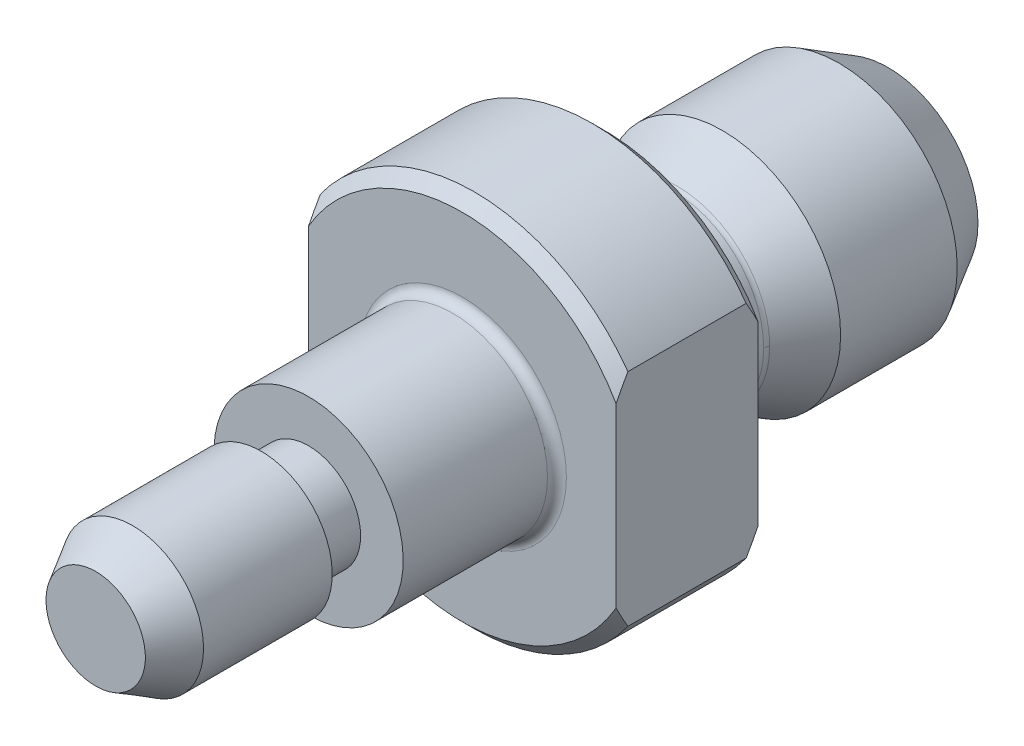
ISO-10303-21;
HEADER;
FILE_DESCRIPTION(('STEP AP214'),'2;1');
FILE_NAME('part.step','',(''),(''),'','','');
FILE_SCHEMA(('AUTOMOTIVE_DESIGN { 1 0 10303 214 1 1 1 1 }'));
ENDSEC;
DATA;
#1=APPLICATION_CONTEXT('core data for automotive mechanical design processes');
#2=APPLICATION_PROTOCOL_DEFINITION('international standard','automotive_design',2000,#1);
#3=PRODUCT_CONTEXT('',#1,'mechanical');
#4=PRODUCT('Part','Part','',(#3));
#5=PRODUCT_RELATED_PRODUCT_CATEGORY('part','',(#4));
#6=PRODUCT_DEFINITION_FORMATION('','',#4);
#7=PRODUCT_DEFINITION_CONTEXT('part definition',#1,'design');
#8=PRODUCT_DEFINITION('design','',#6,#7);
#9=PRODUCT_DEFINITION_SHAPE('','',#8);
#10=(LENGTH_UNIT() NAMED_UNIT(*) SI_UNIT(.MILLI.,.METRE.));
#11=(NAMED_UNIT(*) PLANE_ANGLE_UNIT() SI_UNIT($,.RADIAN.));
#12=(NAMED_UNIT(*) SI_UNIT($,.STERADIAN.) SOLID_ANGLE_UNIT());
#13=UNCERTAINTY_MEASURE_WITH_UNIT(LENGTH_MEASURE(1.E-05),#10,'distance_accuracy_value','');
#14=(GEOMETRIC_REPRESENTATION_CONTEXT(3) GLOBAL_UNCERTAINTY_ASSIGNED_CONTEXT((#13)) GLOBAL_UNIT_ASSIGNED_CONTEXT((#10,
#11,#12)) REPRESENTATION_CONTEXT('',''));
#15=CARTESIAN_POINT('',(0.,0.,0.));
#16=DIRECTION('',(0.,0.,1.));
#17=DIRECTION('',(1.,0.,0.));
#18=AXIS2_PLACEMENT_3D('',#15,#16,#17);
#19=CARTESIAN_POINT('',(-2.1252,-2.132512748,21.5));
#20=DIRECTION('',(0.,0.,1.));
#21=DIRECTION('',(1.,0.,0.));
#22=AXIS2_PLACEMENT_3D('',#19,#20,#21);
#23=PLANE('',#22);
#24=CARTESIAN_POINT('',(0.,0.,21.5));
#25=DIRECTION('',(0.,0.,-1.));
#26=DIRECTION('',(-1.,0.,0.));
#27=AXIS2_PLACEMENT_3D('',#24,#25,#26);
#28=CIRCLE('',#27,2.1);
#29=CARTESIAN_POINT('',(-2.1,0.,21.5));
#30=VERTEX_POINT('',#29);
#31=EDGE_CURVE('E18',#30,#30,#28,.T.);
#32=ORIENTED_EDGE('',*,*,#31,.F.);
#33=EDGE_LOOP('',(#32));
#34=FACE_BOUND('',#33,.T.);
#35=ADVANCED_FACE('F14',(#34),#23,.T.);
#36=CARTESIAN_POINT('',(0.,0.,21.5));
#37=DIRECTION('',(0.,0.,-1.));
#38=DIRECTION('',(-1.,0.,0.));
#39=AXIS2_PLACEMENT_3D('',#36,#37,#38);
#40=CONICAL_SURFACE('',#39,2.1,0.523598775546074);
#41=ORIENTED_EDGE('',*,*,#31,.T.);
#42=EDGE_LOOP('',(#41));
#43=FACE_BOUND('',#42,.T.);
#44=CARTESIAN_POINT('',(0.,0.,19.941154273));
#45=DIRECTION('',(0.,0.,1.));
#46=DIRECTION('',(1.,0.,0.));
#47=AXIS2_PLACEMENT_3D('',#44,#45,#46);
#48=CIRCLE('',#47,3.);
#49=CARTESIAN_POINT('',(3.,0.,19.941154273));
#50=VERTEX_POINT('',#49);
#51=EDGE_CURVE('E211',#50,#50,#48,.F.);
#52=ORIENTED_EDGE('',*,*,#51,.F.);
#53=EDGE_LOOP('',(#52));
#54=FACE_BOUND('',#53,.T.);
#55=ADVANCED_FACE('F325',(#43,#54),#40,.T.);
#56=CARTESIAN_POINT('',(0.,0.,14.5));
#57=DIRECTION('',(0.,0.,1.));
#58=DIRECTION('',(0.,-1.,0.));
#59=AXIS2_PLACEMENT_3D('',#56,#57,#58);
#60=CYLINDRICAL_SURFACE('',#59,3.);
#61=CARTESIAN_POINT('',(0.,0.,14.5));
#62=DIRECTION('',(0.,0.,1.));
#63=DIRECTION('',(0.,-1.,0.));
#64=AXIS2_PLACEMENT_3D('',#61,#62,#63);
#65=CIRCLE('',#64,3.);
#66=CARTESIAN_POINT('',(0.,-3.,14.5));
#67=VERTEX_POINT('',#66);
#68=EDGE_CURVE('E209',#67,#67,#65,.F.);
#69=ORIENTED_EDGE('',*,*,#68,.F.);
#70=EDGE_LOOP('',(#69));
#71=FACE_BOUND('',#70,.T.);
#72=ORIENTED_EDGE('',*,*,#51,.T.);
#73=EDGE_LOOP('',(#72));
#74=FACE_BOUND('',#73,.T.);
#75=ADVANCED_FACE('F331',(#71,#74),#60,.T.);
#76=CARTESIAN_POINT('',(3.036,-3.046446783,14.5));
#77=DIRECTION('',(0.,0.,-1.));
#78=DIRECTION('',(-1.,0.,0.));
#79=AXIS2_PLACEMENT_3D('',#76,#77,#78);
#80=PLANE('',#79);
#81=CARTESIAN_POINT('',(0.,0.,14.5));
#82=DIRECTION('',(0.,0.,1.));
#83=DIRECTION('',(1.,0.,0.));
#84=AXIS2_PLACEMENT_3D('',#81,#82,#83);
#85=CIRCLE('',#84,2.2);
#86=CARTESIAN_POINT('',(2.2,0.,14.5));
#87=VERTEX_POINT('',#86);
#88=EDGE_CURVE('E207',#87,#87,#85,.F.);
#89=ORIENTED_EDGE('',*,*,#88,.F.);
#90=EDGE_LOOP('',(#89));
#91=FACE_BOUND('',#90,.T.);
#92=ORIENTED_EDGE('',*,*,#68,.T.);
#93=EDGE_LOOP('',(#92));
#94=FACE_BOUND('',#93,.T.);
#95=ADVANCED_FACE('F327',(#91,#94),#80,.T.);
#96=CARTESIAN_POINT('',(0.,0.,12.5));
#97=DIRECTION('',(0.,0.,1.));
#98=DIRECTION('',(1.,0.,0.));
#99=AXIS2_PLACEMENT_3D('',#96,#97,#98);
#100=CYLINDRICAL_SURFACE('',#99,2.2);
#101=CARTESIAN_POINT('',(0.,0.,12.5));
#102=DIRECTION('',(0.,0.,1.));
#103=DIRECTION('',(1.,0.,0.));
#104=AXIS2_PLACEMENT_3D('',#101,#102,#103);
#105=CIRCLE('',#104,2.2);
#106=CARTESIAN_POINT('',(2.2,0.,12.5));
#107=VERTEX_POINT('',#106);
#108=EDGE_CURVE('E204',#107,#107,#105,.F.);
#109=ORIENTED_EDGE('',*,*,#108,.F.);
#110=EDGE_LOOP('',(#109));
#111=FACE_BOUND('',#110,.T.);
#112=ORIENTED_EDGE('',*,*,#88,.T.);
#113=EDGE_LOOP('',(#112));
#114=FACE_BOUND('',#113,.T.);
#115=ADVANCED_FACE('F330',(#111,#114),#100,.T.);
#116=CARTESIAN_POINT('',(-4.048,-4.061929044,12.5));
#117=DIRECTION('',(0.,0.,1.));
#118=DIRECTION('',(1.,0.,0.));
#119=AXIS2_PLACEMENT_3D('',#116,#117,#118);
#120=PLANE('',#119);
#121=ORIENTED_EDGE('',*,*,#108,.T.);
#122=EDGE_LOOP('',(#121));
#123=FACE_BOUND('',#122,.T.);
#124=CARTESIAN_POINT('',(0.,0.,12.5));
#125=DIRECTION('',(0.,0.,1.));
#126=DIRECTION('',(0.,-1.,0.));
#127=AXIS2_PLACEMENT_3D('',#124,#125,#126);
#128=CIRCLE('',#127,4.);
#129=CARTESIAN_POINT('',(0.,-4.,12.5));
#130=VERTEX_POINT('',#129);
#131=EDGE_CURVE('E200',#130,#130,#128,.F.);
#132=ORIENTED_EDGE('',*,*,#131,.F.);
#133=EDGE_LOOP('',(#132));
#134=FACE_BOUND('',#133,.T.);
#135=ADVANCED_FACE('F333',(#123,#134),#120,.T.);
#136=CARTESIAN_POINT('',(0.,0.,6.4));
#137=DIRECTION('',(0.,0.,1.));
#138=DIRECTION('',(0.,-1.,0.));
#139=AXIS2_PLACEMENT_3D('',#136,#137,#138);
#140=CYLINDRICAL_SURFACE('',#139,4.);
#141=CARTESIAN_POINT('',(0.,0.,6.4));
#142=DIRECTION('',(0.,0.,1.));
#143=DIRECTION('',(1.,0.,0.));
#144=AXIS2_PLACEMENT_3D('',#141,#142,#143);
#145=CIRCLE('',#144,4.);
#146=CARTESIAN_POINT('',(4.,0.,6.4));
#147=VERTEX_POINT('',#146);
#148=EDGE_CURVE('E203',#147,#147,#145,.T.);
#149=ORIENTED_EDGE('',*,*,#148,.T.);
#150=EDGE_LOOP('',(#149));
#151=FACE_BOUND('',#150,.T.);
#152=ORIENTED_EDGE('',*,*,#131,.T.);
#153=EDGE_LOOP('',(#152));
#154=FACE_BOUND('',#153,.T.);
#155=ADVANCED_FACE('F336',(#151,#154),#140,.T.);
#156=CARTESIAN_POINT('',(0.,0.,6.4));
#157=DIRECTION('',(0.,0.,1.));
#158=DIRECTION('',(1.,0.,0.));
#159=AXIS2_PLACEMENT_3D('',#156,#157,#158);
#160=TOROIDAL_SURFACE('',#159,4.4,0.4);
#161=CARTESIAN_POINT('',(0.,0.,6.));
#162=DIRECTION('',(0.,0.,1.));
#163=DIRECTION('',(1.,0.,0.));
#164=AXIS2_PLACEMENT_3D('',#161,#162,#163);
#165=CIRCLE('',#164,4.399999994);
#166=CARTESIAN_POINT('',(4.399999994,0.,6.));
#167=VERTEX_POINT('',#166);
#168=EDGE_CURVE('E97',#167,#167,#165,.F.);
#169=ORIENTED_EDGE('',*,*,#168,.F.);
#170=EDGE_LOOP('',(#169));
#171=FACE_BOUND('',#170,.T.);
#172=ORIENTED_EDGE('',*,*,#148,.F.);
#173=EDGE_LOOP('',(#172));
#174=FACE_BOUND('',#173,.T.);
#175=ADVANCED_FACE('F338',(#171,#174),#160,.F.);
#176=CARTESIAN_POINT('',(0.,0.,0.5));
#177=DIRECTION('',(0.,0.,1.));
#178=DIRECTION('',(1.,0.,0.));
#179=AXIS2_PLACEMENT_3D('',#176,#177,#178);
#180=CYLINDRICAL_SURFACE('',#179,8.);
#181=CARTESIAN_POINT('',(0.,0.,0.5));
#182=DIRECTION('',(0.,0.,1.));
#183=DIRECTION('',(1.,0.,0.));
#184=AXIS2_PLACEMENT_3D('',#181,#182,#183);
#185=CIRCLE('',#184,8.);
#186=CARTESIAN_POINT('',(6.5,-4.66368952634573,0.499999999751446));
#187=VERTEX_POINT('',#186);
#188=CARTESIAN_POINT('',(-6.5,-4.6636895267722,0.500000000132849));
#189=VERTEX_POINT('',#188);
#190=EDGE_CURVE('E247',#187,#189,#185,.F.);
#191=ORIENTED_EDGE('',*,*,#190,.F.);
#192=DIRECTION('',(0.,0.,-1.));
#193=VECTOR('',#192,1.);
#194=CARTESIAN_POINT('',(6.5,-4.663689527,3.));
#195=LINE('',#194,#193);
#196=CARTESIAN_POINT('',(6.5,-4.6636895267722,5.49999999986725));
#197=VERTEX_POINT('',#196);
#198=EDGE_CURVE('E159',#197,#187,#195,.T.);
#199=ORIENTED_EDGE('',*,*,#198,.F.);
#200=CARTESIAN_POINT('',(0.,0.,5.5));
#201=DIRECTION('',(0.,0.,-1.));
#202=DIRECTION('',(-1.,0.,0.));
#203=AXIS2_PLACEMENT_3D('',#200,#201,#202);
#204=CIRCLE('',#203,8.);
#205=CARTESIAN_POINT('',(-6.5,-4.66368952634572,5.50000000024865));
#206=VERTEX_POINT('',#205);
#207=EDGE_CURVE('E197',#206,#197,#204,.F.);
#208=ORIENTED_EDGE('',*,*,#207,.F.);
#209=DIRECTION('',(0.,0.,1.));
#210=VECTOR('',#209,1.);
#211=CARTESIAN_POINT('',(-6.5,-4.663689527,3.));
#212=LINE('',#211,#210);
#213=EDGE_CURVE('E183',#189,#206,#212,.T.);
#214=ORIENTED_EDGE('',*,*,#213,.F.);
#215=EDGE_LOOP('',(#191,#199,#208,#214));
#216=FACE_BOUND('',#215,.T.);
#217=ADVANCED_FACE('F340',(#216),#180,.T.);
#218=CARTESIAN_POINT('',(0.,0.,0.5));
#219=DIRECTION('',(0.,0.,1.));
#220=DIRECTION('',(1.,0.,0.));
#221=AXIS2_PLACEMENT_3D('',#218,#219,#220);
#222=CYLINDRICAL_SURFACE('',#221,8.);
#223=CARTESIAN_POINT('',(0.,0.,5.5));
#224=DIRECTION('',(0.,0.,-1.));
#225=DIRECTION('',(-1.,0.,0.));
#226=AXIS2_PLACEMENT_3D('',#223,#224,#225);
#227=CIRCLE('',#226,8.);
#228=CARTESIAN_POINT('',(6.5,4.66368952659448,5.50000000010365));
#229=VERTEX_POINT('',#228);
#230=CARTESIAN_POINT('',(-6.5,4.6636895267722,5.49999999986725));
#231=VERTEX_POINT('',#230);
#232=EDGE_CURVE('E98',#229,#231,#227,.F.);
#233=ORIENTED_EDGE('',*,*,#232,.F.);
#234=DIRECTION('',(0.,0.,1.));
#235=VECTOR('',#234,1.);
#236=CARTESIAN_POINT('',(6.5,4.663689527,3.));
#237=LINE('',#236,#235);
#238=CARTESIAN_POINT('',(6.5,4.6636895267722,0.500000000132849));
#239=VERTEX_POINT('',#238);
#240=EDGE_CURVE('E113',#239,#229,#237,.T.);
#241=ORIENTED_EDGE('',*,*,#240,.F.);
#242=CARTESIAN_POINT('',(0.,0.,0.5));
#243=DIRECTION('',(0.,0.,1.));
#244=DIRECTION('',(1.,0.,0.));
#245=AXIS2_PLACEMENT_3D('',#242,#243,#244);
#246=CIRCLE('',#245,8.);
#247=CARTESIAN_POINT('',(-6.5,4.6636895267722,0.500000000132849));
#248=VERTEX_POINT('',#247);
#249=EDGE_CURVE('E254',#248,#239,#246,.F.);
#250=ORIENTED_EDGE('',*,*,#249,.F.);
#251=DIRECTION('',(0.,0.,-1.));
#252=VECTOR('',#251,1.);
#253=CARTESIAN_POINT('',(-6.5,4.663689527,3.));
#254=LINE('',#253,#252);
#255=EDGE_CURVE('E184',#231,#248,#254,.T.);
#256=ORIENTED_EDGE('',*,*,#255,.F.);
#257=EDGE_LOOP('',(#233,#241,#250,#256));
#258=FACE_BOUND('',#257,.T.);
#259=ADVANCED_FACE('F349',(#258),#222,.T.);
#260=CARTESIAN_POINT('',(0.,0.,6.));
#261=DIRECTION('',(0.,0.,-1.));
#262=DIRECTION('',(-1.,0.,0.));
#263=AXIS2_PLACEMENT_3D('',#260,#261,#262);
#264=CONICAL_SURFACE('',#263,7.5,0.785398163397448);
#265=CARTESIAN_POINT('',(0.,0.,6.));
#266=DIRECTION('',(0.,0.,-1.));
#267=DIRECTION('',(-1.,0.,0.));
#268=AXIS2_PLACEMENT_3D('',#265,#266,#267);
#269=CIRCLE('',#268,7.5);
#270=CARTESIAN_POINT('',(6.5,3.7416573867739,6.));
#271=VERTEX_POINT('',#270);
#272=CARTESIAN_POINT('',(-6.5,3.74165738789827,5.9999999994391));
#273=VERTEX_POINT('',#272);
#274=EDGE_CURVE('E87',#271,#273,#269,.F.);
#275=ORIENTED_EDGE('',*,*,#274,.F.);
#276=CARTESIAN_POINT('',(6.50000000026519,4.66368952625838,5.5000000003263));
#277=CARTESIAN_POINT('',(6.50000000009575,4.58815546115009,5.54403197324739));
#278=CARTESIAN_POINT('',(6.50000000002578,4.51231410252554,5.58753977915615));
#279=CARTESIAN_POINT('',(6.49999999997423,4.36000596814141,5.67339851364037));
#280=CARTESIAN_POINT('',(6.49999999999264,4.28353936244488,5.71574974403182));
#281=CARTESIAN_POINT('',(6.50000000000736,4.12992806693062,5.79921121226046));
#282=CARTESIAN_POINT('',(6.50000000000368,4.05278335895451,5.84032141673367));
#283=CARTESIAN_POINT('',(6.49999999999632,3.89776768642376,5.92119893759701));
#284=CARTESIAN_POINT('',(6.49999999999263,3.81989653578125,5.9609658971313));
#285=CARTESIAN_POINT('',(6.5,3.74165738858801,5.999999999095));
#286=B_SPLINE_CURVE_WITH_KNOTS('',3,(#276,#277,#278,#279,#280,#281,#282,#283,#284,#285),
.UNSPECIFIED.,.F.,.F.,(4,2,2,2,4),(0.,0.262293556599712,0.524517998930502,0.786749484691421,
1.04905009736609),.UNSPECIFIED.);
#287=EDGE_CURVE('E91',#229,#271,#286,.T.);
#288=ORIENTED_EDGE('',*,*,#287,.F.);
#289=ORIENTED_EDGE('',*,*,#232,.T.);
#290=CARTESIAN_POINT('',(-6.50000000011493,3.74165738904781,5.9999999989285));
#291=CARTESIAN_POINT('',(-6.5000000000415,3.81989653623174,5.96096589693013));
#292=CARTESIAN_POINT('',(-6.50000000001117,3.89776768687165,5.92119893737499));
#293=CARTESIAN_POINT('',(-6.49999999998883,4.05278335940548,5.84032141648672));
#294=CARTESIAN_POINT('',(-6.49999999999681,4.12992806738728,5.79921121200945));
#295=CARTESIAN_POINT('',(-6.50000000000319,4.28353936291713,5.71574974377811));
#296=CARTESIAN_POINT('',(-6.5000000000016,4.36000596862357,5.67339851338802));
#297=CARTESIAN_POINT('',(-6.4999999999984,4.51231410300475,5.58753977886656));
#298=CARTESIAN_POINT('',(-6.49999999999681,4.58815546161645,5.5440319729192));
#299=CARTESIAN_POINT('',(-6.5,4.66368952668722,5.49999999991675));
#300=B_SPLINE_CURVE_WITH_KNOTS('',3,(#290,#291,#292,#293,#294,#295,#296,#297,#298,#299),
.UNSPECIFIED.,.F.,.F.,(4,2,2,2,4),(0.,0.262300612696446,0.524532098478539,0.78675654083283,
1.0490500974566),.UNSPECIFIED.);
#301=EDGE_CURVE('E94',#273,#231,#300,.T.);
#302=ORIENTED_EDGE('',*,*,#301,.F.);
#303=EDGE_LOOP('',(#275,#288,#289,#302));
#304=FACE_BOUND('',#303,.T.);
#305=ADVANCED_FACE('F89',(#304),#264,.T.);
#306=CARTESIAN_POINT('',(-6.5,-7.654775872,6.));
#307=DIRECTION('',(0.,0.,1.));
#308=DIRECTION('',(1.,0.,0.));
#309=AXIS2_PLACEMENT_3D('',#306,#307,#308);
#310=PLANE('',#309);
#311=ORIENTED_EDGE('',*,*,#168,.T.);
#312=EDGE_LOOP('',(#311));
#313=FACE_BOUND('',#312,.T.);
#314=CARTESIAN_POINT('',(0.,0.,6.));
#315=DIRECTION('',(0.,0.,-1.));
#316=DIRECTION('',(-1.,0.,0.));
#317=AXIS2_PLACEMENT_3D('',#314,#315,#316);
#318=CIRCLE('',#317,7.5);
#319=CARTESIAN_POINT('',(6.5,-3.7416573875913,5.99999999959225));
#320=VERTEX_POINT('',#319);
#321=CARTESIAN_POINT('',(-6.5,-3.7416573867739,6.));
#322=VERTEX_POINT('',#321);
#323=EDGE_CURVE('E104',#320,#322,#318,.T.);
#324=ORIENTED_EDGE('',*,*,#323,.F.);
#325=DIRECTION('',(0.,-1.,0.));
#326=VECTOR('',#325,1.);
#327=CARTESIAN_POINT('',(6.5,0.,6.));
#328=LINE('',#327,#326);
#329=EDGE_CURVE('E101',#271,#320,#328,.T.);
#330=ORIENTED_EDGE('',*,*,#329,.F.);
#331=ORIENTED_EDGE('',*,*,#274,.T.);
#332=DIRECTION('',(0.,1.,0.));
#333=VECTOR('',#332,1.);
#334=CARTESIAN_POINT('',(-6.5,0.,6.));
#335=LINE('',#334,#333);
#336=EDGE_CURVE('E195',#322,#273,#335,.T.);
#337=ORIENTED_EDGE('',*,*,#336,.F.);
#338=EDGE_LOOP('',(#324,#330,#331,#337));
#339=FACE_BOUND('',#338,.T.);
#340=ADVANCED_FACE('F102',(#313,#339),#310,.T.);
#341=CARTESIAN_POINT('',(0.,0.,6.));
#342=DIRECTION('',(0.,0.,-1.));
#343=DIRECTION('',(-1.,0.,0.));
#344=AXIS2_PLACEMENT_3D('',#341,#342,#343);
#345=CONICAL_SURFACE('',#344,7.5,0.785398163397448);
#346=ORIENTED_EDGE('',*,*,#207,.T.);
#347=CARTESIAN_POINT('',(6.5,-3.74165738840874,5.9999999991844));
#348=CARTESIAN_POINT('',(6.5,-3.81989653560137,5.9609658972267));
#349=CARTESIAN_POINT('',(6.5,-3.89776768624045,5.92119893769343));
#350=CARTESIAN_POINT('',(6.5,-4.05278335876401,5.84032141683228));
#351=CARTESIAN_POINT('',(6.5,-4.12992806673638,5.79921121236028));
#352=CARTESIAN_POINT('',(6.5,-4.28353936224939,5.71574974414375));
#353=CARTESIAN_POINT('',(6.5,-4.3600059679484,5.67339851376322));
#354=CARTESIAN_POINT('',(6.5,-4.51231410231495,5.58753977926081));
#355=CARTESIAN_POINT('',(6.5,-4.58815546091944,5.54403197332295));
#356=CARTESIAN_POINT('',(6.5,-4.66368952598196,5.5000000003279));
#357=B_SPLINE_CURVE_WITH_KNOTS('',3,(#347,#348,#349,#350,#351,#352,#353,#354,#355,#356),
.UNSPECIFIED.,.F.,.F.,(4,2,2,2,4),(0.,0.262300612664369,0.524532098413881,0.78675654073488,
1.04905009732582),.UNSPECIFIED.);
#358=EDGE_CURVE('E108',#320,#197,#357,.T.);
#359=ORIENTED_EDGE('',*,*,#358,.F.);
#360=ORIENTED_EDGE('',*,*,#323,.T.);
#361=CARTESIAN_POINT('',(-6.5,-4.66368952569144,5.50000000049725));
#362=CARTESIAN_POINT('',(-6.5,-4.5881554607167,5.54403197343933));
#363=CARTESIAN_POINT('',(-6.5,-4.51231410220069,5.58753977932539));
#364=CARTESIAN_POINT('',(-6.5,-4.36000596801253,5.6733985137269));
#365=CARTESIAN_POINT('',(-6.5,-4.28353936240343,5.71574974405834));
#366=CARTESIAN_POINT('',(-6.5,-4.12992806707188,5.7992112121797));
#367=CARTESIAN_POINT('',(-6.5,-4.05278335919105,5.84032141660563));
#368=CARTESIAN_POINT('',(-6.5,-3.89776768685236,5.92119893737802));
#369=CARTESIAN_POINT('',(-6.5,-3.81989653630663,5.96096589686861));
#370=CARTESIAN_POINT('',(-6.5,-3.74165738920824,5.99999999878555));
#371=B_SPLINE_CURVE_WITH_KNOTS('',3,(#361,#362,#363,#364,#365,#366,#367,#368,#369,#370),
.UNSPECIFIED.,.F.,.F.,(4,2,2,2,4),(0.,0.262293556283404,0.524517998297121,0.786749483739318,
1.04905009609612),.UNSPECIFIED.);
#372=EDGE_CURVE('E185',#206,#322,#371,.T.);
#373=ORIENTED_EDGE('',*,*,#372,.F.);
#374=EDGE_LOOP('',(#346,#359,#360,#373));
#375=FACE_BOUND('',#374,.T.);
#376=ADVANCED_FACE('F169',(#375),#345,.T.);
#377=CARTESIAN_POINT('',(0.,0.,0.));
#378=DIRECTION('',(0.,0.,1.));
#379=DIRECTION('',(0.,-1.,0.));
#380=AXIS2_PLACEMENT_3D('',#377,#378,#379);
#381=CONICAL_SURFACE('',#380,7.5,0.785398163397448);
#382=CARTESIAN_POINT('',(0.,0.,0.));
#383=DIRECTION('',(0.,0.,1.));
#384=DIRECTION('',(0.,-1.,0.));
#385=AXIS2_PLACEMENT_3D('',#382,#383,#384);
#386=CIRCLE('',#385,7.5);
#387=CARTESIAN_POINT('',(6.5,-3.74165738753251,3.784472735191E-10));
#388=VERTEX_POINT('',#387);
#389=CARTESIAN_POINT('',(-6.5,-3.74165738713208,1.78648762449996E-10));
#390=VERTEX_POINT('',#389);
#391=EDGE_CURVE('E233',#388,#390,#386,.F.);
#392=ORIENTED_EDGE('',*,*,#391,.F.);
#393=CARTESIAN_POINT('',(6.5,-4.66368952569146,0.499999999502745));
#394=CARTESIAN_POINT('',(6.5,-4.58815546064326,0.455968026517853));
#395=CARTESIAN_POINT('',(6.5,-4.51231410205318,0.41246022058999));
#396=CARTESIAN_POINT('',(6.5,-4.36000596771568,0.326601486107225));
#397=CARTESIAN_POINT('',(6.5,-4.2835393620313,0.284250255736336));
#398=CARTESIAN_POINT('',(6.5,-4.12992806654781,0.200788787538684));
#399=CARTESIAN_POINT('',(6.5,-4.05278335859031,0.159678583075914));
#400=CARTESIAN_POINT('',(6.5,-3.89776768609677,0.0788010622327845));
#401=CARTESIAN_POINT('',(6.5,-3.81989653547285,0.0390341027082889));
#402=CARTESIAN_POINT('',(6.5,-3.74165738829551,7.59097645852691E-10));
#403=B_SPLINE_CURVE_WITH_KNOTS('',3,(#393,#394,#395,#396,#397,#398,#399,#400,#401,#402),
.UNSPECIFIED.,.F.,.F.,(4,2,2,2,4),(0.,0.262293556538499,0.524517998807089,0.78674948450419,
1.04905009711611),.UNSPECIFIED.);
#404=EDGE_CURVE('E151',#187,#388,#403,.T.);
#405=ORIENTED_EDGE('',*,*,#404,.F.);
#406=ORIENTED_EDGE('',*,*,#190,.T.);
#407=CARTESIAN_POINT('',(-6.5,-3.74165738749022,3.5734956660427E-10));
#408=CARTESIAN_POINT('',(-6.5,-3.81989653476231,0.0390341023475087));
#409=CARTESIAN_POINT('',(-6.5,-3.89776768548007,0.0788010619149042));
#410=CARTESIAN_POINT('',(-6.5,-4.05278335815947,0.159678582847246));
#411=CARTESIAN_POINT('',(-6.5,-4.12992806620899,0.200788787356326));
#412=CARTESIAN_POINT('',(-6.5,-4.2835393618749,0.284250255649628));
#413=CARTESIAN_POINT('',(-6.5,-4.36000596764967,0.326601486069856));
#414=CARTESIAN_POINT('',(-6.5,-4.51231410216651,0.412460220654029));
#415=CARTESIAN_POINT('',(-6.5,-4.58815546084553,0.455968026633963));
#416=CARTESIAN_POINT('',(-6.5,-4.66368952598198,0.499999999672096));
#417=B_SPLINE_CURVE_WITH_KNOTS('',3,(#407,#408,#409,#410,#411,#412,#413,#414,#415,#416),
.UNSPECIFIED.,.F.,.F.,(4,2,2,2,4),(0.,0.262300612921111,0.524532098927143,0.78675654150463,
1.04905009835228),.UNSPECIFIED.);
#418=EDGE_CURVE('E176',#390,#189,#417,.T.);
#419=ORIENTED_EDGE('',*,*,#418,.F.);
#420=EDGE_LOOP('',(#392,#405,#406,#419));
#421=FACE_BOUND('',#420,.T.);
#422=ADVANCED_FACE('F166',(#421),#381,.T.);
#423=CARTESIAN_POINT('',(-6.5,-4.663689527,0.));
#424=DIRECTION('',(-1.,0.,0.));
#425=DIRECTION('',(0.,0.,1.));
#426=AXIS2_PLACEMENT_3D('',#423,#424,#425);
#427=PLANE('',#426);
#428=ORIENTED_EDGE('',*,*,#213,.T.);
#429=ORIENTED_EDGE('',*,*,#372,.T.);
#430=ORIENTED_EDGE('',*,*,#336,.T.);
#431=ORIENTED_EDGE('',*,*,#301,.T.);
#432=ORIENTED_EDGE('',*,*,#255,.T.);
#433=CARTESIAN_POINT('',(-6.5,3.74165738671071,-3.15511505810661E-11));
#434=CARTESIAN_POINT('',(-6.5,3.81989653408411,0.0390341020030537));
#435=CARTESIAN_POINT('',(-6.5,3.89776768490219,0.0788010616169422));
#436=CARTESIAN_POINT('',(-6.5,4.05278335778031,0.159678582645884));
#437=CARTESIAN_POINT('',(-6.5,4.12992806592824,0.20078878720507));
#438=CARTESIAN_POINT('',(-6.5,4.28353936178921,0.284250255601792));
#439=CARTESIAN_POINT('',(-6.5,4.36000596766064,0.326601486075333));
#440=CARTESIAN_POINT('',(-6.5,4.51231410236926,0.412460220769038));
#441=CARTESIAN_POINT('',(-6.5,4.5881554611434,0.455968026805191));
#442=CARTESIAN_POINT('',(-6.5,4.66368952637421,0.499999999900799));
#443=B_SPLINE_CURVE_WITH_KNOTS('',3,(#433,#434,#435,#436,#437,#438,#439,#440,#441,#442),
.UNSPECIFIED.,.F.,.F.,(4,2,2,2,4),(0.,0.262300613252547,0.524532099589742,0.786756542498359,
1.04905009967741),.UNSPECIFIED.);
#444=CARTESIAN_POINT('',(-6.5,3.74165738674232,-1.57998614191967E-11));
#445=VERTEX_POINT('',#444);
#446=EDGE_CURVE('E160',#445,#248,#443,.T.);
#447=ORIENTED_EDGE('',*,*,#446,.F.);
#448=DIRECTION('',(0.,1.,0.));
#449=VECTOR('',#448,1.);
#450=CARTESIAN_POINT('',(-6.5,0.,0.));
#451=LINE('',#450,#449);
#452=EDGE_CURVE('E232',#390,#445,#451,.T.);
#453=ORIENTED_EDGE('',*,*,#452,.F.);
#454=ORIENTED_EDGE('',*,*,#418,.T.);
#455=EDGE_LOOP('',(#428,#429,#430,#431,#432,#447,#453,#454));
#456=FACE_BOUND('',#455,.T.);
#457=ADVANCED_FACE('F145',(#456),#427,.T.);
#458=CARTESIAN_POINT('',(0.,0.,0.));
#459=DIRECTION('',(0.,0.,1.));
#460=DIRECTION('',(0.,-1.,0.));
#461=AXIS2_PLACEMENT_3D('',#458,#459,#460);
#462=CONICAL_SURFACE('',#461,7.5,0.785398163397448);
#463=ORIENTED_EDGE('',*,*,#249,.T.);
#464=CARTESIAN_POINT('',(6.4999999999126,3.74165738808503,7.01948915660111E-10));
#465=CARTESIAN_POINT('',(6.49999999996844,3.81989653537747,0.0390341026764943));
#466=CARTESIAN_POINT('',(6.4999999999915,3.89776768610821,0.0788010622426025));
#467=CARTESIAN_POINT('',(6.50000000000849,4.05278335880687,0.159678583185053));
#468=CARTESIAN_POINT('',(6.50000000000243,4.12992806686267,0.200788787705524));
#469=CARTESIAN_POINT('',(6.49999999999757,4.28353936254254,0.284250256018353));
#470=CARTESIAN_POINT('',(6.49999999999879,4.36000596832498,0.326601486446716));
#471=CARTESIAN_POINT('',(6.50000000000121,4.5123141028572,0.412460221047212));
#472=CARTESIAN_POINT('',(6.50000000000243,4.58815546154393,0.455968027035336));
#473=CARTESIAN_POINT('',(6.5,4.66368952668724,0.500000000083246));
#474=B_SPLINE_CURVE_WITH_KNOTS('',3,(#464,#465,#466,#467,#468,#469,#470,#471,#472,#473),
.UNSPECIFIED.,.F.,.F.,(4,2,2,2,4),(0.,0.262300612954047,0.524532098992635,0.78675654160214,
1.04905009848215),.UNSPECIFIED.);
#475=CARTESIAN_POINT('',(6.5,3.74165738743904,3.31797089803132E-10));
#476=VERTEX_POINT('',#475);
#477=EDGE_CURVE('E115',#476,#239,#474,.T.);
#478=ORIENTED_EDGE('',*,*,#477,.F.);
#479=CARTESIAN_POINT('',(0.,0.,0.));
#480=DIRECTION('',(0.,0.,1.));
#481=DIRECTION('',(0.,-1.,0.));
#482=AXIS2_PLACEMENT_3D('',#479,#480,#481);
#483=CIRCLE('',#482,7.5);
#484=EDGE_CURVE('E230',#445,#476,#483,.F.);
#485=ORIENTED_EDGE('',*,*,#484,.F.);
#486=ORIENTED_EDGE('',*,*,#446,.T.);
#487=EDGE_LOOP('',(#463,#478,#485,#486));
#488=FACE_BOUND('',#487,.T.);
#489=ADVANCED_FACE('F144',(#488),#462,.T.);
#490=CARTESIAN_POINT('',(6.5,-4.663689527,6.));
#491=DIRECTION('',(1.,0.,0.));
#492=DIRECTION('',(0.,0.,-1.));
#493=AXIS2_PLACEMENT_3D('',#490,#491,#492);
#494=PLANE('',#493);
#495=ORIENTED_EDGE('',*,*,#329,.T.);
#496=ORIENTED_EDGE('',*,*,#358,.T.);
#497=ORIENTED_EDGE('',*,*,#198,.T.);
#498=ORIENTED_EDGE('',*,*,#404,.T.);
#499=DIRECTION('',(0.,-1.,0.));
#500=VECTOR('',#499,1.);
#501=CARTESIAN_POINT('',(6.5,0.,0.));
#502=LINE('',#501,#500);
#503=EDGE_CURVE('E229',#476,#388,#502,.T.);
#504=ORIENTED_EDGE('',*,*,#503,.F.);
#505=ORIENTED_EDGE('',*,*,#477,.T.);
#506=ORIENTED_EDGE('',*,*,#240,.T.);
#507=ORIENTED_EDGE('',*,*,#287,.T.);
#508=EDGE_LOOP('',(#495,#496,#497,#498,#504,#505,#506,#507));
#509=FACE_BOUND('',#508,.T.);
#510=ADVANCED_FACE('F110',(#509),#494,.T.);
#511=CARTESIAN_POINT('',(6.5,-7.654775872,0.));
#512=DIRECTION('',(0.,0.,-1.));
#513=DIRECTION('',(-1.,0.,0.));
#514=AXIS2_PLACEMENT_3D('',#511,#512,#513);
#515=PLANE('',#514);
#516=CARTESIAN_POINT('',(0.,0.,0.));
#517=DIRECTION('',(0.,0.,1.));
#518=DIRECTION('',(1.,0.,0.));
#519=AXIS2_PLACEMENT_3D('',#516,#517,#518);
#520=CIRCLE('',#519,4.25);
#521=CARTESIAN_POINT('',(4.25,0.,0.));
#522=VERTEX_POINT('',#521);
#523=EDGE_CURVE('E225',#522,#522,#520,.T.);
#524=ORIENTED_EDGE('',*,*,#523,.T.);
#525=EDGE_LOOP('',(#524));
#526=FACE_BOUND('',#525,.T.);
#527=ORIENTED_EDGE('',*,*,#484,.T.);
#528=ORIENTED_EDGE('',*,*,#503,.T.);
#529=ORIENTED_EDGE('',*,*,#391,.T.);
#530=ORIENTED_EDGE('',*,*,#452,.T.);
#531=EDGE_LOOP('',(#527,#528,#529,#530));
#532=FACE_BOUND('',#531,.T.);
#533=ADVANCED_FACE('F143',(#526,#532),#515,.T.);
#534=CARTESIAN_POINT('',(0.,0.,-0.4));
#535=DIRECTION('',(0.,0.,1.));
#536=DIRECTION('',(1.,0.,0.));
#537=AXIS2_PLACEMENT_3D('',#534,#535,#536);
#538=TOROIDAL_SURFACE('',#537,4.25,0.4);
#539=ORIENTED_EDGE('',*,*,#523,.F.);
#540=EDGE_LOOP('',(#539));
#541=FACE_BOUND('',#540,.T.);
#542=CARTESIAN_POINT('',(0.,0.,-0.4));
#543=DIRECTION('',(0.,0.,1.));
#544=DIRECTION('',(1.,0.,0.));
#545=AXIS2_PLACEMENT_3D('',#542,#543,#544);
#546=CIRCLE('',#545,3.85);
#547=CARTESIAN_POINT('',(3.85,0.,-0.4));
#548=VERTEX_POINT('',#547);
#549=EDGE_CURVE('E228',#548,#548,#546,.F.);
#550=ORIENTED_EDGE('',*,*,#549,.F.);
#551=EDGE_LOOP('',(#550));
#552=FACE_BOUND('',#551,.T.);
#553=ADVANCED_FACE('F297',(#541,#552),#538,.F.);
#554=CARTESIAN_POINT('',(0.,0.,-2.89282032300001));
#555=DIRECTION('',(0.,0.,1.));
#556=DIRECTION('',(0.,-1.,0.));
#557=AXIS2_PLACEMENT_3D('',#554,#555,#556);
#558=CYLINDRICAL_SURFACE('',#557,3.85);
#559=ORIENTED_EDGE('',*,*,#549,.T.);
#560=EDGE_LOOP('',(#559));
#561=FACE_BOUND('',#560,.T.);
#562=CARTESIAN_POINT('',(0.,0.,-2.89282032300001));
#563=DIRECTION('',(0.,0.,1.));
#564=DIRECTION('',(0.,-1.,0.));
#565=AXIS2_PLACEMENT_3D('',#562,#563,#564);
#566=CIRCLE('',#565,3.85);
#567=CARTESIAN_POINT('',(3.85,-3.45705469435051E-10,-2.89282032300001));
#568=VERTEX_POINT('',#567);
#569=CARTESIAN_POINT('',(-3.85,-1.18447229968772E-09,-2.89282032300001));
#570=VERTEX_POINT('',#569);
#571=EDGE_CURVE('E274',#568,#570,#566,.T.);
#572=ORIENTED_EDGE('',*,*,#571,.T.);
#573=CARTESIAN_POINT('',(0.,0.,-2.89282032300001));
#574=DIRECTION('',(0.,0.,1.));
#575=DIRECTION('',(0.,-1.,0.));
#576=AXIS2_PLACEMENT_3D('',#573,#574,#575);
#577=CIRCLE('',#576,3.85);
#578=EDGE_CURVE('E266',#570,#568,#577,.T.);
#579=ORIENTED_EDGE('',*,*,#578,.T.);
#580=EDGE_LOOP('',(#572,#579));
#581=FACE_BOUND('',#580,.T.);
#582=ADVANCED_FACE('F294',(#561,#581),#558,.T.);
#583=CARTESIAN_POINT('',(-3.903589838,0.,-3.092820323));
#584=CARTESIAN_POINT('',(-3.903589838,-7.807179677,-3.09282032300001));
#585=CARTESIAN_POINT('',(3.903589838,-7.807179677,-3.09282032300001));
#586=CARTESIAN_POINT('',(3.903589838,0.,-3.092820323));
#587=CARTESIAN_POINT('',(-3.868278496,0.,-3.03165928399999));
#588=CARTESIAN_POINT('',(-3.868278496,-7.73655699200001,-3.03165928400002));
#589=CARTESIAN_POINT('',(3.868278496,-7.73655699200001,-3.03165928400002));
#590=CARTESIAN_POINT('',(3.868278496,0.,-3.03165928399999));
#591=CARTESIAN_POINT('',(-3.85,0.,-2.96344300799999));
#592=CARTESIAN_POINT('',(-3.85,-7.70000000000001,-2.963443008));
#593=CARTESIAN_POINT('',(3.85,-7.70000000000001,-2.963443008));
#594=CARTESIAN_POINT('',(3.85,0.,-2.96344300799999));
#595=CARTESIAN_POINT('',(-3.85,0.,-2.89282032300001));
#596=CARTESIAN_POINT('',(-3.85,-7.7,-2.89282032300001));
#597=CARTESIAN_POINT('',(3.85,-7.7,-2.89282032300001));
#598=CARTESIAN_POINT('',(3.85,0.,-2.89282032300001));
#599=(BOUNDED_SURFACE() B_SPLINE_SURFACE(3,3,((#583,#584,#585,#586),(#587,#588,#589,#590),(#591,
#592,#593,#594),(#595,#596,#597,#598)),.UNSPECIFIED.,.F.,.F.,
.F.) B_SPLINE_SURFACE_WITH_KNOTS((4,4),(4,4),(0.,1.),(0.,1.),
.UNSPECIFIED.) GEOMETRIC_REPRESENTATION_ITEM() RATIONAL_B_SPLINE_SURFACE(((1.,0.333333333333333,
0.333333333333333,1.),(0.977283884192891,0.325761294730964,0.325761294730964,0.977283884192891),
(0.977283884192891,0.325761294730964,0.325761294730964,0.977283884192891),(1.,0.333333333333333,
0.333333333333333,1.))) REPRESENTATION_ITEM('') SURFACE());
#600=CARTESIAN_POINT('',(-3.903589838,0.,-3.092820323));
#601=CARTESIAN_POINT('',(-3.868278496,0.,-3.03165928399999));
#602=CARTESIAN_POINT('',(-3.85,0.,-2.96344300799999));
#603=CARTESIAN_POINT('',(-3.85,0.,-2.89282032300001));
#604=(BOUNDED_CURVE() B_SPLINE_CURVE(3,(#600,#601,#602,#603),.UNSPECIFIED.,.F.,
.F.) B_SPLINE_CURVE_WITH_KNOTS((4,4),(0.,1.),
.UNSPECIFIED.) CURVE() GEOMETRIC_REPRESENTATION_ITEM() RATIONAL_B_SPLINE_CURVE((1.,
0.977283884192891,0.977283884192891,1.)) REPRESENTATION_ITEM(''));
#605=CARTESIAN_POINT('',(-3.90358983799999,-8.76293738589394E-11,-3.092820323));
#606=VERTEX_POINT('',#605);
#607=EDGE_CURVE('E270',#570,#606,#604,.F.);
#608=CARTESIAN_POINT('',(0.,0.,-3.0928203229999));
#609=DIRECTION('',(0.,0.,-1.));
#610=DIRECTION('',(-1.,0.,0.));
#611=AXIS2_PLACEMENT_3D('',#608,#609,#610);
#612=CIRCLE('',#611,3.903589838);
#613=CARTESIAN_POINT('',(3.90358983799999,-4.00319829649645E-10,-3.092820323));
#614=VERTEX_POINT('',#613);
#615=EDGE_CURVE('E33',#614,#606,#612,.T.);
#616=CARTESIAN_POINT('',(3.903589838,0.,-3.092820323));
#617=CARTESIAN_POINT('',(3.868278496,0.,-3.03165928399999));
#618=CARTESIAN_POINT('',(3.85,0.,-2.96344300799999));
#619=CARTESIAN_POINT('',(3.85,0.,-2.89282032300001));
#620=(BOUNDED_CURVE() B_SPLINE_CURVE(3,(#616,#617,#618,#619),.UNSPECIFIED.,.F.,
.F.) B_SPLINE_CURVE_WITH_KNOTS((4,4),(0.,1.),
.UNSPECIFIED.) CURVE() GEOMETRIC_REPRESENTATION_ITEM() RATIONAL_B_SPLINE_CURVE((1.,
0.977283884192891,0.977283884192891,1.)) REPRESENTATION_ITEM(''));
#621=EDGE_CURVE('E269',#614,#568,#620,.T.);
#622=ORIENTED_EDGE('',*,*,#607,.T.);
#623=ORIENTED_EDGE('',*,*,#615,.F.);
#624=ORIENTED_EDGE('',*,*,#621,.T.);
#625=ORIENTED_EDGE('',*,*,#578,.F.);
#626=EDGE_LOOP('',(#622,#623,#624,#625));
#627=FACE_BOUND('',#626,.T.);
#628=ADVANCED_FACE('F306',(#627),#599,.F.);
#629=CARTESIAN_POINT('',(3.903589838,0.,-3.092820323));
#630=CARTESIAN_POINT('',(3.903589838,7.807179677,-3.09282032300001));
#631=CARTESIAN_POINT('',(-3.903589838,7.807179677,-3.09282032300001));
#632=CARTESIAN_POINT('',(-3.903589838,0.,-3.092820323));
#633=CARTESIAN_POINT('',(3.868278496,0.,-3.03165928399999));
#634=CARTESIAN_POINT('',(3.868278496,7.73655699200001,-3.03165928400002));
#635=CARTESIAN_POINT('',(-3.868278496,7.73655699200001,-3.03165928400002));
#636=CARTESIAN_POINT('',(-3.868278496,0.,-3.03165928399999));
#637=CARTESIAN_POINT('',(3.85,0.,-2.96344300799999));
#638=CARTESIAN_POINT('',(3.85,7.70000000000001,-2.963443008));
#639=CARTESIAN_POINT('',(-3.85,7.70000000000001,-2.963443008));
#640=CARTESIAN_POINT('',(-3.85,0.,-2.96344300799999));
#641=CARTESIAN_POINT('',(3.85,0.,-2.89282032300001));
#642=CARTESIAN_POINT('',(3.85,7.7,-2.89282032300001));
#643=CARTESIAN_POINT('',(-3.85,7.7,-2.89282032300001));
#644=CARTESIAN_POINT('',(-3.85,0.,-2.89282032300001));
#645=(BOUNDED_SURFACE() B_SPLINE_SURFACE(3,3,((#629,#630,#631,#632),(#633,#634,#635,#636),(#637,
#638,#639,#640),(#641,#642,#643,#644)),.UNSPECIFIED.,.F.,.F.,
.F.) B_SPLINE_SURFACE_WITH_KNOTS((4,4),(4,4),(0.,1.),(0.,1.),
.UNSPECIFIED.) GEOMETRIC_REPRESENTATION_ITEM() RATIONAL_B_SPLINE_SURFACE(((1.,0.333333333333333,
0.333333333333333,1.),(0.977283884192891,0.325761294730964,0.325761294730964,0.977283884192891),
(0.977283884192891,0.325761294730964,0.325761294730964,0.977283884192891),(1.,0.333333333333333,
0.333333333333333,1.))) REPRESENTATION_ITEM('') SURFACE());
#646=CARTESIAN_POINT('',(0.,0.,-3.0928203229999));
#647=DIRECTION('',(0.,0.,-1.));
#648=DIRECTION('',(-1.,0.,0.));
#649=AXIS2_PLACEMENT_3D('',#646,#647,#648);
#650=CIRCLE('',#649,3.903589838);
#651=EDGE_CURVE('E287',#606,#614,#650,.T.);
#652=ORIENTED_EDGE('',*,*,#571,.F.);
#653=ORIENTED_EDGE('',*,*,#621,.F.);
#654=ORIENTED_EDGE('',*,*,#651,.F.);
#655=ORIENTED_EDGE('',*,*,#607,.F.);
#656=EDGE_LOOP('',(#652,#653,#654,#655));
#657=FACE_BOUND('',#656,.T.);
#658=ADVANCED_FACE('F492',(#657),#645,.F.);
#659=CARTESIAN_POINT('',(0.,0.,-3.092820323));
#660=DIRECTION('',(0.,0.,-1.));
#661=DIRECTION('',(0.,1.,0.));
#662=AXIS2_PLACEMENT_3D('',#659,#660,#661);
#663=CONICAL_SURFACE('',#662,3.903589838,0.523598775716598);
#664=CARTESIAN_POINT('',(0.,0.,-4.991858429));
#665=DIRECTION('',(0.,0.,1.));
#666=DIRECTION('',(1.,0.,0.));
#667=AXIS2_PLACEMENT_3D('',#664,#665,#666);
#668=CIRCLE('',#667,5.);
#669=CARTESIAN_POINT('',(5.,0.,-4.991858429));
#670=VERTEX_POINT('',#669);
#671=EDGE_CURVE('E224',#670,#670,#668,.F.);
#672=ORIENTED_EDGE('',*,*,#671,.F.);
#673=EDGE_LOOP('',(#672));
#674=FACE_BOUND('',#673,.T.);
#675=ORIENTED_EDGE('',*,*,#651,.T.);
#676=ORIENTED_EDGE('',*,*,#615,.T.);
#677=EDGE_LOOP('',(#675,#676));
#678=FACE_BOUND('',#677,.T.);
#679=ADVANCED_FACE('F499',(#674,#678),#663,.T.);
#680=CARTESIAN_POINT('',(3.8456,-3.858832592,-12.));
#681=DIRECTION('',(0.,0.,-1.));
#682=DIRECTION('',(-1.,0.,0.));
#683=AXIS2_PLACEMENT_3D('',#680,#681,#682);
#684=PLANE('',#683);
#685=CARTESIAN_POINT('',(0.,0.,-12.));
#686=DIRECTION('',(0.,0.,1.));
#687=DIRECTION('',(1.,0.,0.));
#688=AXIS2_PLACEMENT_3D('',#685,#686,#687);
#689=CIRCLE('',#688,3.8);
#690=CARTESIAN_POINT('',(3.8,0.,-12.));
#691=VERTEX_POINT('',#690);
#692=EDGE_CURVE('E24',#691,#691,#689,.T.);
#693=ORIENTED_EDGE('',*,*,#692,.F.);
#694=EDGE_LOOP('',(#693));
#695=FACE_BOUND('',#694,.T.);
#696=ADVANCED_FACE('F16',(#695),#684,.T.);
#697=CARTESIAN_POINT('',(0.,0.,-9.921539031));
#698=DIRECTION('',(0.,0.,1.));
#699=DIRECTION('',(1.,0.,0.));
#700=AXIS2_PLACEMENT_3D('',#697,#698,#699);
#701=CYLINDRICAL_SURFACE('',#700,5.);
#702=ORIENTED_EDGE('',*,*,#671,.T.);
#703=EDGE_LOOP('',(#702));
#704=FACE_BOUND('',#703,.T.);
#705=CARTESIAN_POINT('',(0.,0.,-9.921539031));
#706=DIRECTION('',(0.,0.,1.));
#707=DIRECTION('',(1.,0.,0.));
#708=AXIS2_PLACEMENT_3D('',#705,#706,#707);
#709=CIRCLE('',#708,5.);
#710=CARTESIAN_POINT('',(5.,0.,-9.92153903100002));
#711=VERTEX_POINT('',#710);
#712=EDGE_CURVE('E9',#711,#711,#709,.F.);
#713=ORIENTED_EDGE('',*,*,#712,.F.);
#714=EDGE_LOOP('',(#713));
#715=FACE_BOUND('',#714,.T.);
#716=ADVANCED_FACE('F311',(#704,#715),#701,.T.);
#717=CARTESIAN_POINT('',(0.,0.,-12.));
#718=DIRECTION('',(0.,0.,1.));
#719=DIRECTION('',(1.,0.,0.));
#720=AXIS2_PLACEMENT_3D('',#717,#718,#719);
#721=CONICAL_SURFACE('',#720,3.8,0.523598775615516);
#722=ORIENTED_EDGE('',*,*,#712,.T.);
#723=EDGE_LOOP('',(#722));
#724=FACE_BOUND('',#723,.T.);
#725=ORIENTED_EDGE('',*,*,#692,.T.);
#726=EDGE_LOOP('',(#725));
#727=FACE_BOUND('',#726,.T.);
#728=ADVANCED_FACE('F309',(#724,#727),#721,.T.);
#729=CLOSED_SHELL('',(#35,#55,#75,#95,#115,#135,#155,#175,#217,#259,#305,#340,#376,#422,#457,
#489,#510,#533,#553,#582,#628,#658,#679,#696,#716,#728));
#730=MANIFOLD_SOLID_BREP('B1',#729);
#731=ADVANCED_BREP_SHAPE_REPRESENTATION('',(#18,#730),#14);
#732=SHAPE_DEFINITION_REPRESENTATION(#9,#731);
ENDSEC;
END-ISO-10303-21;
